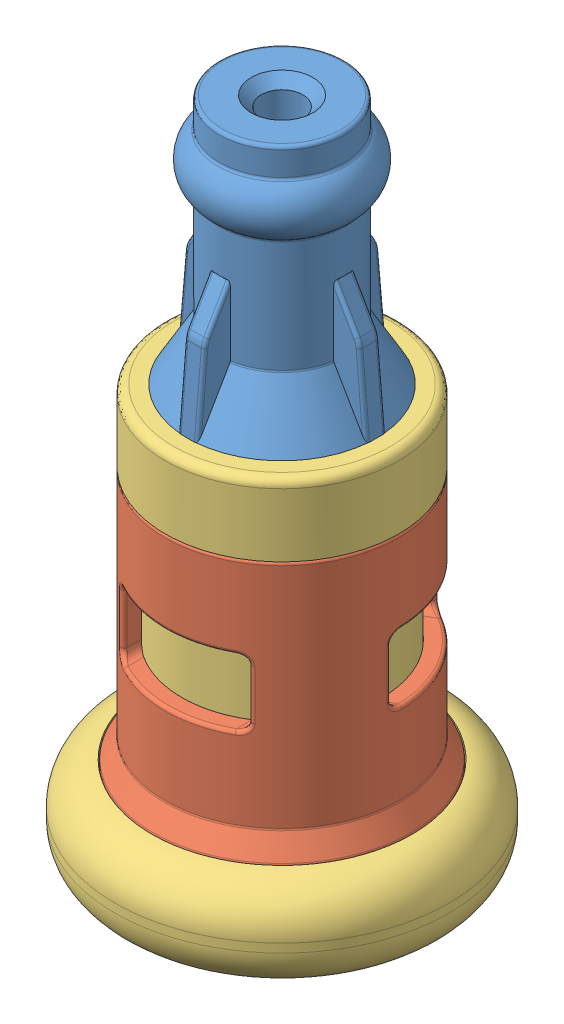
SolidWorks assembly 3D Drawing View.SLDASM, configuration Default (file format 4100). Lengths in mm.
Overall size (25.4 50.8 25.4).
3 component instances, 3 part files, 8 mates.
Components (placement in the parent):
- Part1-1: Part1.SLDPRT [Default] at origin size (14.42 50.8 14.42)
- Part2-1: Part2.SLDPRT [Default] at origin size (19.69 22.1 19.69)
- Main-Body-2: Main-Body.SLDPRT [Default] at origin size (25.4 31.75 25.4)
Mates (geometry in assembly coordinates):
- InPlace1: in place: plane of ?
- Coincident1: coincident aligned: plane of Part1-1; plane of assembly
- Coincident2: coincident aligned: plane of ? through (0 0 0) normal (0 1 0)
- Coincident3: coincident anti-aligned: plane of ? through (0 0 0) normal (1 0 0)
- InPlace2: in place: unknown of ?
- Coincident4: coincident aligned: plane of Part2-1; plane of assembly
- Coincident5: coincident aligned: plane of ? through (0 0 0) normal (0 1 0)
- Coincident6: coincident anti-aligned: plane of ? through (0 0 0) normal (1 0 0)
